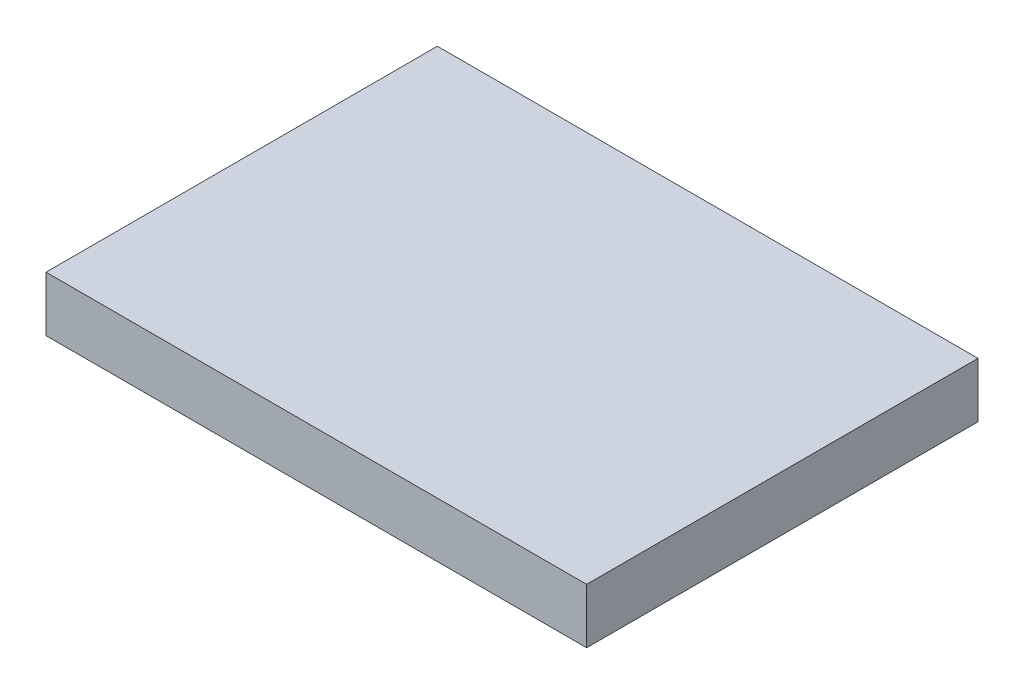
ISO-10303-21;
HEADER;
FILE_DESCRIPTION(('STEP AP214'),'2;1');
FILE_NAME('part.step','',(''),(''),'','','');
FILE_SCHEMA(('AUTOMOTIVE_DESIGN { 1 0 10303 214 1 1 1 1 }'));
ENDSEC;
DATA;
#1=APPLICATION_CONTEXT('core data for automotive mechanical design processes');
#2=APPLICATION_PROTOCOL_DEFINITION('international standard','automotive_design',2000,#1);
#3=PRODUCT_CONTEXT('',#1,'mechanical');
#4=PRODUCT('Part','Part','',(#3));
#5=PRODUCT_RELATED_PRODUCT_CATEGORY('part','',(#4));
#6=PRODUCT_DEFINITION_FORMATION('','',#4);
#7=PRODUCT_DEFINITION_CONTEXT('part definition',#1,'design');
#8=PRODUCT_DEFINITION('design','',#6,#7);
#9=PRODUCT_DEFINITION_SHAPE('','',#8);
#10=(LENGTH_UNIT() NAMED_UNIT(*) SI_UNIT(.MILLI.,.METRE.));
#11=(NAMED_UNIT(*) PLANE_ANGLE_UNIT() SI_UNIT($,.RADIAN.));
#12=(NAMED_UNIT(*) SI_UNIT($,.STERADIAN.) SOLID_ANGLE_UNIT());
#13=UNCERTAINTY_MEASURE_WITH_UNIT(LENGTH_MEASURE(1.E-05),#10,'distance_accuracy_value','');
#14=(GEOMETRIC_REPRESENTATION_CONTEXT(3) GLOBAL_UNCERTAINTY_ASSIGNED_CONTEXT((#13)) GLOBAL_UNIT_ASSIGNED_CONTEXT((#10,
#11,#12)) REPRESENTATION_CONTEXT('',''));
#15=CARTESIAN_POINT('',(0.,0.,0.));
#16=DIRECTION('',(0.,0.,1.));
#17=DIRECTION('',(1.,0.,0.));
#18=AXIS2_PLACEMENT_3D('',#15,#16,#17);
#19=CARTESIAN_POINT('',(-99.9572440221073,20.32,72.3614093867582));
#20=DIRECTION('',(-1.,0.,0.));
#21=DIRECTION('',(0.,0.,1.));
#22=AXIS2_PLACEMENT_3D('',#19,#20,#21);
#23=PLANE('',#22);
#24=DIRECTION('',(0.,0.,-1.));
#25=VECTOR('',#24,1.);
#26=CARTESIAN_POINT('',(-99.9572440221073,0.,72.3614093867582));
#27=LINE('',#26,#25);
#28=CARTESIAN_POINT('',(-99.9572440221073,0.,72.3614093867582));
#29=VERTEX_POINT('',#28);
#30=CARTESIAN_POINT('',(-99.9572440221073,0.,-72.3614093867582));
#31=VERTEX_POINT('',#30);
#32=EDGE_CURVE('E97',#29,#31,#27,.T.);
#33=ORIENTED_EDGE('',*,*,#32,.F.);
#34=DIRECTION('',(0.,-1.,0.));
#35=VECTOR('',#34,1.);
#36=CARTESIAN_POINT('',(-99.9572440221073,20.32,72.3614093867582));
#37=LINE('',#36,#35);
#38=CARTESIAN_POINT('',(-99.9572440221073,20.32,72.3614093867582));
#39=VERTEX_POINT('',#38);
#40=EDGE_CURVE('E11',#39,#29,#37,.T.);
#41=ORIENTED_EDGE('',*,*,#40,.F.);
#42=DIRECTION('',(0.,0.,-1.));
#43=VECTOR('',#42,1.);
#44=CARTESIAN_POINT('',(-99.9572440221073,20.32,72.3614093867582));
#45=LINE('',#44,#43);
#46=CARTESIAN_POINT('',(-99.9572440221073,20.32,-72.3614093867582));
#47=VERTEX_POINT('',#46);
#48=EDGE_CURVE('E92',#39,#47,#45,.T.);
#49=ORIENTED_EDGE('',*,*,#48,.T.);
#50=DIRECTION('',(0.,-1.,0.));
#51=VECTOR('',#50,1.);
#52=CARTESIAN_POINT('',(-99.9572440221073,20.32,-72.3614093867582));
#53=LINE('',#52,#51);
#54=EDGE_CURVE('E35',#47,#31,#53,.T.);
#55=ORIENTED_EDGE('',*,*,#54,.T.);
#56=EDGE_LOOP('',(#33,#41,#49,#55));
#57=FACE_BOUND('',#56,.T.);
#58=ADVANCED_FACE('F32',(#57),#23,.T.);
#59=CARTESIAN_POINT('',(-99.9572440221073,20.32,72.3614093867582));
#60=DIRECTION('',(0.,0.,-1.));
#61=DIRECTION('',(-1.,0.,0.));
#62=AXIS2_PLACEMENT_3D('',#59,#60,#61);
#63=PLANE('',#62);
#64=DIRECTION('',(1.,0.,0.));
#65=VECTOR('',#64,1.);
#66=CARTESIAN_POINT('',(-99.9572440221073,0.,72.3614093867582));
#67=LINE('',#66,#65);
#68=CARTESIAN_POINT('',(99.9572440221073,0.,72.3614093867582));
#69=VERTEX_POINT('',#68);
#70=EDGE_CURVE('E65',#29,#69,#67,.T.);
#71=ORIENTED_EDGE('',*,*,#70,.T.);
#72=DIRECTION('',(0.,-1.,0.));
#73=VECTOR('',#72,1.);
#74=CARTESIAN_POINT('',(99.9572440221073,20.32,72.3614093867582));
#75=LINE('',#74,#73);
#76=CARTESIAN_POINT('',(99.9572440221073,20.32,72.3614093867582));
#77=VERTEX_POINT('',#76);
#78=EDGE_CURVE('E41',#77,#69,#75,.T.);
#79=ORIENTED_EDGE('',*,*,#78,.F.);
#80=DIRECTION('',(1.,0.,0.));
#81=VECTOR('',#80,1.);
#82=CARTESIAN_POINT('',(-99.9572440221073,20.32,72.3614093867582));
#83=LINE('',#82,#81);
#84=EDGE_CURVE('E82',#39,#77,#83,.T.);
#85=ORIENTED_EDGE('',*,*,#84,.F.);
#86=ORIENTED_EDGE('',*,*,#40,.T.);
#87=EDGE_LOOP('',(#71,#79,#85,#86));
#88=FACE_BOUND('',#87,.T.);
#89=ADVANCED_FACE('F107',(#88),#63,.F.);
#90=CARTESIAN_POINT('',(99.9572440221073,20.32,72.3614093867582));
#91=DIRECTION('',(-1.,0.,0.));
#92=DIRECTION('',(0.,0.,1.));
#93=AXIS2_PLACEMENT_3D('',#90,#91,#92);
#94=PLANE('',#93);
#95=DIRECTION('',(0.,0.,-1.));
#96=VECTOR('',#95,1.);
#97=CARTESIAN_POINT('',(99.9572440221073,0.,72.3614093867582));
#98=LINE('',#97,#96);
#99=CARTESIAN_POINT('',(99.9572440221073,0.,-72.3614093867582));
#100=VERTEX_POINT('',#99);
#101=EDGE_CURVE('E89',#69,#100,#98,.T.);
#102=ORIENTED_EDGE('',*,*,#101,.T.);
#103=DIRECTION('',(0.,-1.,0.));
#104=VECTOR('',#103,1.);
#105=CARTESIAN_POINT('',(99.9572440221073,20.32,-72.3614093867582));
#106=LINE('',#105,#104);
#107=CARTESIAN_POINT('',(99.9572440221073,20.32,-72.3614093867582));
#108=VERTEX_POINT('',#107);
#109=EDGE_CURVE('E86',#108,#100,#106,.T.);
#110=ORIENTED_EDGE('',*,*,#109,.F.);
#111=DIRECTION('',(0.,0.,-1.));
#112=VECTOR('',#111,1.);
#113=CARTESIAN_POINT('',(99.9572440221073,20.32,72.3614093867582));
#114=LINE('',#113,#112);
#115=EDGE_CURVE('E77',#77,#108,#114,.T.);
#116=ORIENTED_EDGE('',*,*,#115,.F.);
#117=ORIENTED_EDGE('',*,*,#78,.T.);
#118=EDGE_LOOP('',(#102,#110,#116,#117));
#119=FACE_BOUND('',#118,.T.);
#120=ADVANCED_FACE('F87',(#119),#94,.F.);
#121=CARTESIAN_POINT('',(-99.9572440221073,20.32,-72.3614093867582));
#122=DIRECTION('',(0.,0.,-1.));
#123=DIRECTION('',(-1.,0.,0.));
#124=AXIS2_PLACEMENT_3D('',#121,#122,#123);
#125=PLANE('',#124);
#126=DIRECTION('',(1.,0.,0.));
#127=VECTOR('',#126,1.);
#128=CARTESIAN_POINT('',(-99.9572440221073,0.,-72.3614093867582));
#129=LINE('',#128,#127);
#130=EDGE_CURVE('E100',#31,#100,#129,.T.);
#131=ORIENTED_EDGE('',*,*,#130,.F.);
#132=ORIENTED_EDGE('',*,*,#54,.F.);
#133=DIRECTION('',(1.,0.,0.));
#134=VECTOR('',#133,1.);
#135=CARTESIAN_POINT('',(-99.9572440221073,20.32,-72.3614093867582));
#136=LINE('',#135,#134);
#137=EDGE_CURVE('E81',#47,#108,#136,.T.);
#138=ORIENTED_EDGE('',*,*,#137,.T.);
#139=ORIENTED_EDGE('',*,*,#109,.T.);
#140=EDGE_LOOP('',(#131,#132,#138,#139));
#141=FACE_BOUND('',#140,.T.);
#142=ADVANCED_FACE('F91',(#141),#125,.T.);
#143=CARTESIAN_POINT('',(0.,20.32,0.));
#144=DIRECTION('',(0.,-1.,0.));
#145=DIRECTION('',(0.,0.,-1.));
#146=AXIS2_PLACEMENT_3D('',#143,#144,#145);
#147=PLANE('',#146);
#148=ORIENTED_EDGE('',*,*,#48,.F.);
#149=ORIENTED_EDGE('',*,*,#84,.T.);
#150=ORIENTED_EDGE('',*,*,#115,.T.);
#151=ORIENTED_EDGE('',*,*,#137,.F.);
#152=EDGE_LOOP('',(#148,#149,#150,#151));
#153=FACE_BOUND('',#152,.T.);
#154=ADVANCED_FACE('F80',(#153),#147,.F.);
#155=CARTESIAN_POINT('',(0.,0.,0.));
#156=DIRECTION('',(0.,-1.,0.));
#157=DIRECTION('',(0.,0.,-1.));
#158=AXIS2_PLACEMENT_3D('',#155,#156,#157);
#159=PLANE('',#158);
#160=ORIENTED_EDGE('',*,*,#32,.T.);
#161=ORIENTED_EDGE('',*,*,#130,.T.);
#162=ORIENTED_EDGE('',*,*,#101,.F.);
#163=ORIENTED_EDGE('',*,*,#70,.F.);
#164=EDGE_LOOP('',(#160,#161,#162,#163));
#165=FACE_BOUND('',#164,.T.);
#166=ADVANCED_FACE('F105',(#165),#159,.T.);
#167=CLOSED_SHELL('',(#58,#89,#120,#142,#154,#166));
#168=MANIFOLD_SOLID_BREP('B2',#167);
#169=ADVANCED_BREP_SHAPE_REPRESENTATION('',(#18,#168),#14);
#170=SHAPE_DEFINITION_REPRESENTATION(#9,#169);
ENDSEC;
END-ISO-10303-21;
